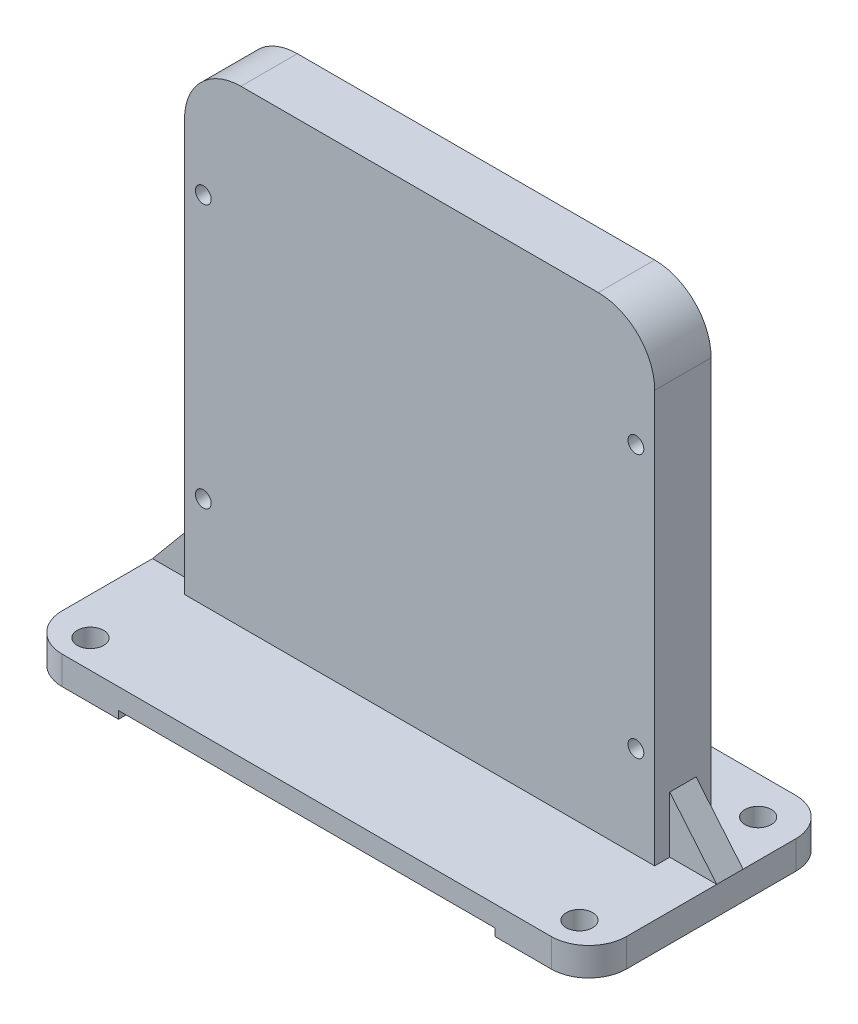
ISO-10303-21;
HEADER;
FILE_DESCRIPTION(('STEP AP214'),'2;1');
FILE_NAME('part.step','',(''),(''),'','','');
FILE_SCHEMA(('AUTOMOTIVE_DESIGN { 1 0 10303 214 1 1 1 1 }'));
ENDSEC;
DATA;
#1=APPLICATION_CONTEXT('core data for automotive mechanical design processes');
#2=APPLICATION_PROTOCOL_DEFINITION('international standard','automotive_design',2000,#1);
#3=PRODUCT_CONTEXT('',#1,'mechanical');
#4=PRODUCT('Part','Part','',(#3));
#5=PRODUCT_RELATED_PRODUCT_CATEGORY('part','',(#4));
#6=PRODUCT_DEFINITION_FORMATION('','',#4);
#7=PRODUCT_DEFINITION_CONTEXT('part definition',#1,'design');
#8=PRODUCT_DEFINITION('design','',#6,#7);
#9=PRODUCT_DEFINITION_SHAPE('','',#8);
#10=(LENGTH_UNIT() NAMED_UNIT(*) SI_UNIT(.MILLI.,.METRE.));
#11=(NAMED_UNIT(*) PLANE_ANGLE_UNIT() SI_UNIT($,.RADIAN.));
#12=(NAMED_UNIT(*) SI_UNIT($,.STERADIAN.) SOLID_ANGLE_UNIT());
#13=UNCERTAINTY_MEASURE_WITH_UNIT(LENGTH_MEASURE(1.E-05),#10,'distance_accuracy_value','');
#14=(GEOMETRIC_REPRESENTATION_CONTEXT(3) GLOBAL_UNCERTAINTY_ASSIGNED_CONTEXT((#13)) GLOBAL_UNIT_ASSIGNED_CONTEXT((#10,
#11,#12)) REPRESENTATION_CONTEXT('',''));
#15=CARTESIAN_POINT('',(0.,0.,0.));
#16=DIRECTION('',(0.,0.,1.));
#17=DIRECTION('',(1.,0.,0.));
#18=AXIS2_PLACEMENT_3D('',#15,#16,#17);
#19=CARTESIAN_POINT('',(62.5,-66.,7.5));
#20=DIRECTION('',(0.,1.,0.));
#21=DIRECTION('',(0.,0.,1.));
#22=AXIS2_PLACEMENT_3D('',#19,#20,#21);
#23=PLANE('',#22);
#24=CARTESIAN_POINT('',(-65.,-66.,30.));
#25=DIRECTION('',(0.,1.,0.));
#26=DIRECTION('',(0.,0.,1.));
#27=AXIS2_PLACEMENT_3D('',#24,#25,#26);
#28=CIRCLE('',#27,3.5);
#29=CARTESIAN_POINT('',(-65.,-66.,33.5));
#30=VERTEX_POINT('',#29);
#31=EDGE_CURVE('E264',#30,#30,#28,.T.);
#32=ORIENTED_EDGE('',*,*,#31,.T.);
#33=EDGE_LOOP('',(#32));
#34=FACE_BOUND('',#33,.T.);
#35=CARTESIAN_POINT('',(-65.,-66.,-17.5));
#36=DIRECTION('',(0.,1.,0.));
#37=DIRECTION('',(0.,0.,1.));
#38=AXIS2_PLACEMENT_3D('',#35,#36,#37);
#39=CIRCLE('',#38,3.5);
#40=CARTESIAN_POINT('',(-65.,-66.,-14.));
#41=VERTEX_POINT('',#40);
#42=EDGE_CURVE('E260',#41,#41,#39,.T.);
#43=ORIENTED_EDGE('',*,*,#42,.T.);
#44=EDGE_LOOP('',(#43));
#45=FACE_BOUND('',#44,.T.);
#46=DIRECTION('',(1.,0.,0.));
#47=VECTOR('',#46,1.);
#48=CARTESIAN_POINT('',(75.,-66.,-27.5));
#49=LINE('',#48,#47);
#50=CARTESIAN_POINT('',(-65.,-66.,-27.5));
#51=VERTEX_POINT('',#50);
#52=CARTESIAN_POINT('',(-50.0000000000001,-66.,-27.5));
#53=VERTEX_POINT('',#52);
#54=EDGE_CURVE('E324',#51,#53,#49,.T.);
#55=ORIENTED_EDGE('',*,*,#54,.T.);
#56=DIRECTION('',(0.,0.,1.));
#57=VECTOR('',#56,1.);
#58=CARTESIAN_POINT('',(-50.0000000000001,-66.,7.5));
#59=LINE('',#58,#57);
#60=CARTESIAN_POINT('',(-50.0000000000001,-66.,37.5));
#61=VERTEX_POINT('',#60);
#62=EDGE_CURVE('E11',#53,#61,#59,.T.);
#63=ORIENTED_EDGE('',*,*,#62,.T.);
#64=DIRECTION('',(-1.,0.,0.));
#65=VECTOR('',#64,1.);
#66=CARTESIAN_POINT('',(75.,-66.,37.5));
#67=LINE('',#66,#65);
#68=CARTESIAN_POINT('',(-65.,-66.,37.5));
#69=VERTEX_POINT('',#68);
#70=EDGE_CURVE('E330',#61,#69,#67,.T.);
#71=ORIENTED_EDGE('',*,*,#70,.T.);
#72=CARTESIAN_POINT('',(-65.,-66.,27.5));
#73=DIRECTION('',(0.,1.,0.));
#74=DIRECTION('',(0.,0.,1.));
#75=AXIS2_PLACEMENT_3D('',#72,#73,#74);
#76=CIRCLE('',#75,10.);
#77=CARTESIAN_POINT('',(-75.,-66.,27.5));
#78=VERTEX_POINT('',#77);
#79=EDGE_CURVE('E386',#69,#78,#76,.F.);
#80=ORIENTED_EDGE('',*,*,#79,.T.);
#81=DIRECTION('',(0.,0.,-1.));
#82=VECTOR('',#81,1.);
#83=CARTESIAN_POINT('',(-75.,-66.,37.5));
#84=LINE('',#83,#82);
#85=CARTESIAN_POINT('',(-75.,-66.,-17.5));
#86=VERTEX_POINT('',#85);
#87=EDGE_CURVE('E306',#78,#86,#84,.T.);
#88=ORIENTED_EDGE('',*,*,#87,.T.);
#89=CARTESIAN_POINT('',(-65.,-66.,-17.5));
#90=DIRECTION('',(0.,1.,0.));
#91=DIRECTION('',(0.,0.,1.));
#92=AXIS2_PLACEMENT_3D('',#89,#90,#91);
#93=CIRCLE('',#92,10.);
#94=EDGE_CURVE('E388',#86,#51,#93,.F.);
#95=ORIENTED_EDGE('',*,*,#94,.T.);
#96=EDGE_LOOP('',(#55,#63,#71,#80,#88,#95));
#97=FACE_BOUND('',#96,.T.);
#98=ADVANCED_FACE('F36',(#34,#45,#97),#23,.F.);
#99=CARTESIAN_POINT('',(0.,-58.5,0.));
#100=DIRECTION('',(0.,1.,0.));
#101=DIRECTION('',(0.,0.,1.));
#102=AXIS2_PLACEMENT_3D('',#99,#100,#101);
#103=PLANE('',#102);
#104=CARTESIAN_POINT('',(65.,-58.5,-17.5));
#105=DIRECTION('',(0.,1.,0.));
#106=DIRECTION('',(0.,0.,1.));
#107=AXIS2_PLACEMENT_3D('',#104,#105,#106);
#108=CIRCLE('',#107,3.5);
#109=CARTESIAN_POINT('',(65.,-58.5,-14.));
#110=VERTEX_POINT('',#109);
#111=EDGE_CURVE('E245',#110,#110,#108,.T.);
#112=ORIENTED_EDGE('',*,*,#111,.F.);
#113=EDGE_LOOP('',(#112));
#114=FACE_BOUND('',#113,.T.);
#115=CARTESIAN_POINT('',(-65.,-58.5,-17.5));
#116=DIRECTION('',(0.,1.,0.));
#117=DIRECTION('',(0.,0.,1.));
#118=AXIS2_PLACEMENT_3D('',#115,#116,#117);
#119=CIRCLE('',#118,3.5);
#120=CARTESIAN_POINT('',(-65.,-58.5,-14.));
#121=VERTEX_POINT('',#120);
#122=EDGE_CURVE('E257',#121,#121,#119,.T.);
#123=ORIENTED_EDGE('',*,*,#122,.F.);
#124=EDGE_LOOP('',(#123));
#125=FACE_BOUND('',#124,.T.);
#126=DIRECTION('',(0.,0.,1.));
#127=VECTOR('',#126,1.);
#128=CARTESIAN_POINT('',(75.,-58.5,37.5));
#129=LINE('',#128,#127);
#130=CARTESIAN_POINT('',(75.,-58.5,-17.5));
#131=VERTEX_POINT('',#130);
#132=CARTESIAN_POINT('',(75.,-58.5,-3.5));
#133=VERTEX_POINT('',#132);
#134=EDGE_CURVE('E315',#131,#133,#129,.T.);
#135=ORIENTED_EDGE('',*,*,#134,.F.);
#136=CARTESIAN_POINT('',(65.,-58.5,-17.5));
#137=DIRECTION('',(0.,1.,0.));
#138=DIRECTION('',(0.,0.,1.));
#139=AXIS2_PLACEMENT_3D('',#136,#137,#138);
#140=CIRCLE('',#139,10.);
#141=CARTESIAN_POINT('',(65.,-58.5,-27.5));
#142=VERTEX_POINT('',#141);
#143=EDGE_CURVE('E401',#131,#142,#140,.T.);
#144=ORIENTED_EDGE('',*,*,#143,.T.);
#145=DIRECTION('',(1.,0.,0.));
#146=VECTOR('',#145,1.);
#147=CARTESIAN_POINT('',(75.,-58.5,-27.5));
#148=LINE('',#147,#146);
#149=CARTESIAN_POINT('',(-65.,-58.5,-27.5));
#150=VERTEX_POINT('',#149);
#151=EDGE_CURVE('E309',#150,#142,#148,.T.);
#152=ORIENTED_EDGE('',*,*,#151,.F.);
#153=CARTESIAN_POINT('',(-65.,-58.5,-17.5));
#154=DIRECTION('',(0.,1.,0.));
#155=DIRECTION('',(0.,0.,1.));
#156=AXIS2_PLACEMENT_3D('',#153,#154,#155);
#157=CIRCLE('',#156,10.);
#158=CARTESIAN_POINT('',(-75.,-58.5,-17.5));
#159=VERTEX_POINT('',#158);
#160=EDGE_CURVE('E399',#150,#159,#157,.T.);
#161=ORIENTED_EDGE('',*,*,#160,.T.);
#162=DIRECTION('',(0.,0.,-1.));
#163=VECTOR('',#162,1.);
#164=CARTESIAN_POINT('',(-75.,-58.5,37.5));
#165=LINE('',#164,#163);
#166=CARTESIAN_POINT('',(-75.,-58.5,-3.5));
#167=VERTEX_POINT('',#166);
#168=EDGE_CURVE('E311',#167,#159,#165,.T.);
#169=ORIENTED_EDGE('',*,*,#168,.F.);
#170=DIRECTION('',(1.,0.,0.));
#171=VECTOR('',#170,1.);
#172=CARTESIAN_POINT('',(0.,-58.5,-3.5));
#173=LINE('',#172,#171);
#174=CARTESIAN_POINT('',(-62.5,-58.5,-3.5));
#175=VERTEX_POINT('',#174);
#176=EDGE_CURVE('E291',#167,#175,#173,.T.);
#177=ORIENTED_EDGE('',*,*,#176,.T.);
#178=DIRECTION('',(0.,0.,1.));
#179=VECTOR('',#178,1.);
#180=CARTESIAN_POINT('',(-62.5,-58.5,7.5));
#181=LINE('',#180,#179);
#182=CARTESIAN_POINT('',(-62.5,-58.5,-7.5));
#183=VERTEX_POINT('',#182);
#184=EDGE_CURVE('E338',#183,#175,#181,.T.);
#185=ORIENTED_EDGE('',*,*,#184,.F.);
#186=DIRECTION('',(1.,0.,0.));
#187=VECTOR('',#186,1.);
#188=CARTESIAN_POINT('',(47.5,-58.5,-7.5));
#189=LINE('',#188,#187);
#190=CARTESIAN_POINT('',(62.5,-58.5,-7.5));
#191=VERTEX_POINT('',#190);
#192=EDGE_CURVE('E377',#183,#191,#189,.T.);
#193=ORIENTED_EDGE('',*,*,#192,.T.);
#194=DIRECTION('',(0.,0.,-1.));
#195=VECTOR('',#194,1.);
#196=CARTESIAN_POINT('',(62.5,-58.5,7.5));
#197=LINE('',#196,#195);
#198=CARTESIAN_POINT('',(62.5,-58.5,-3.5));
#199=VERTEX_POINT('',#198);
#200=EDGE_CURVE('E321',#199,#191,#197,.T.);
#201=ORIENTED_EDGE('',*,*,#200,.F.);
#202=DIRECTION('',(1.,0.,0.));
#203=VECTOR('',#202,1.);
#204=CARTESIAN_POINT('',(0.,-58.5,-3.5));
#205=LINE('',#204,#203);
#206=EDGE_CURVE('E271',#199,#133,#205,.T.);
#207=ORIENTED_EDGE('',*,*,#206,.T.);
#208=EDGE_LOOP('',(#135,#144,#152,#161,#169,#177,#185,#193,#201,#207));
#209=FACE_BOUND('',#208,.T.);
#210=ADVANCED_FACE('F445',(#114,#125,#209),#103,.T.);
#211=CARTESIAN_POINT('',(-62.5,50.9999999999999,7.5));
#212=DIRECTION('',(1.,0.,0.));
#213=DIRECTION('',(0.,1.,0.));
#214=AXIS2_PLACEMENT_3D('',#211,#212,#213);
#215=PLANE('',#214);
#216=DIRECTION('',(0.,0.,-1.));
#217=VECTOR('',#216,1.);
#218=CARTESIAN_POINT('',(-62.5,50.9999999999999,7.5));
#219=LINE('',#218,#217);
#220=CARTESIAN_POINT('',(-62.5,50.9999999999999,7.5));
#221=VERTEX_POINT('',#220);
#222=CARTESIAN_POINT('',(-62.5,50.9999999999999,-7.5));
#223=VERTEX_POINT('',#222);
#224=EDGE_CURVE('E356',#221,#223,#219,.T.);
#225=ORIENTED_EDGE('',*,*,#224,.T.);
#226=DIRECTION('',(0.,-1.,0.));
#227=VECTOR('',#226,1.);
#228=CARTESIAN_POINT('',(-62.5,50.9999999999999,-7.5));
#229=LINE('',#228,#227);
#230=EDGE_CURVE('E343',#223,#183,#229,.T.);
#231=ORIENTED_EDGE('',*,*,#230,.T.);
#232=ORIENTED_EDGE('',*,*,#184,.T.);
#233=DIRECTION('',(0.,-1.,0.));
#234=VECTOR('',#233,1.);
#235=CARTESIAN_POINT('',(-62.5,50.9999999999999,-3.5));
#236=LINE('',#235,#234);
#237=CARTESIAN_POINT('',(-62.5,-43.5,-3.5));
#238=VERTEX_POINT('',#237);
#239=EDGE_CURVE('E296',#238,#175,#236,.T.);
#240=ORIENTED_EDGE('',*,*,#239,.F.);
#241=DIRECTION('',(0.,0.,-1.));
#242=VECTOR('',#241,1.);
#243=CARTESIAN_POINT('',(-62.5,-43.5,7.5));
#244=LINE('',#243,#242);
#245=CARTESIAN_POINT('',(-62.5,-43.5,3.5));
#246=VERTEX_POINT('',#245);
#247=EDGE_CURVE('E303',#238,#246,#244,.F.);
#248=ORIENTED_EDGE('',*,*,#247,.T.);
#249=DIRECTION('',(0.,-1.,0.));
#250=VECTOR('',#249,1.);
#251=CARTESIAN_POINT('',(-62.5,50.9999999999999,3.5));
#252=LINE('',#251,#250);
#253=CARTESIAN_POINT('',(-62.5,-58.5,3.5));
#254=VERTEX_POINT('',#253);
#255=EDGE_CURVE('E300',#246,#254,#252,.T.);
#256=ORIENTED_EDGE('',*,*,#255,.T.);
#257=CARTESIAN_POINT('',(-62.5,-58.5,7.5));
#258=VERTEX_POINT('',#257);
#259=EDGE_CURVE('E337',#254,#258,#181,.T.);
#260=ORIENTED_EDGE('',*,*,#259,.T.);
#261=DIRECTION('',(0.,-1.,0.));
#262=VECTOR('',#261,1.);
#263=CARTESIAN_POINT('',(-62.5,50.9999999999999,7.5));
#264=LINE('',#263,#262);
#265=EDGE_CURVE('E344',#221,#258,#264,.T.);
#266=ORIENTED_EDGE('',*,*,#265,.F.);
#267=EDGE_LOOP('',(#225,#231,#232,#240,#248,#256,#260,#266));
#268=FACE_BOUND('',#267,.T.);
#269=ADVANCED_FACE('F465',(#268),#215,.F.);
#270=CARTESIAN_POINT('',(62.5,50.9999999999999,7.5));
#271=DIRECTION('',(-1.,0.,0.));
#272=DIRECTION('',(0.,-1.,0.));
#273=AXIS2_PLACEMENT_3D('',#270,#271,#272);
#274=PLANE('',#273);
#275=CARTESIAN_POINT('',(62.5,-58.5,7.5));
#276=VERTEX_POINT('',#275);
#277=CARTESIAN_POINT('',(62.5,-58.5,3.5));
#278=VERTEX_POINT('',#277);
#279=EDGE_CURVE('E334',#276,#278,#197,.T.);
#280=ORIENTED_EDGE('',*,*,#279,.T.);
#281=DIRECTION('',(0.,1.,0.));
#282=VECTOR('',#281,1.);
#283=CARTESIAN_POINT('',(62.5,50.9999999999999,3.5));
#284=LINE('',#283,#282);
#285=CARTESIAN_POINT('',(62.5,-43.5,3.5));
#286=VERTEX_POINT('',#285);
#287=EDGE_CURVE('E281',#278,#286,#284,.T.);
#288=ORIENTED_EDGE('',*,*,#287,.T.);
#289=DIRECTION('',(0.,0.,-1.));
#290=VECTOR('',#289,1.);
#291=CARTESIAN_POINT('',(62.5,-43.5,7.5));
#292=LINE('',#291,#290);
#293=CARTESIAN_POINT('',(62.5,-43.5,-3.5));
#294=VERTEX_POINT('',#293);
#295=EDGE_CURVE('E284',#286,#294,#292,.T.);
#296=ORIENTED_EDGE('',*,*,#295,.T.);
#297=DIRECTION('',(0.,1.,0.));
#298=VECTOR('',#297,1.);
#299=CARTESIAN_POINT('',(62.5,50.9999999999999,-3.5));
#300=LINE('',#299,#298);
#301=EDGE_CURVE('E276',#199,#294,#300,.T.);
#302=ORIENTED_EDGE('',*,*,#301,.F.);
#303=ORIENTED_EDGE('',*,*,#200,.T.);
#304=DIRECTION('',(0.,1.,0.));
#305=VECTOR('',#304,1.);
#306=CARTESIAN_POINT('',(62.5,50.9999999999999,-7.5));
#307=LINE('',#306,#305);
#308=CARTESIAN_POINT('',(62.5,50.9999999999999,-7.5));
#309=VERTEX_POINT('',#308);
#310=EDGE_CURVE('E359',#191,#309,#307,.T.);
#311=ORIENTED_EDGE('',*,*,#310,.T.);
#312=DIRECTION('',(0.,0.,-1.));
#313=VECTOR('',#312,1.);
#314=CARTESIAN_POINT('',(62.5,50.9999999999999,7.5));
#315=LINE('',#314,#313);
#316=CARTESIAN_POINT('',(62.5,50.9999999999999,7.5));
#317=VERTEX_POINT('',#316);
#318=EDGE_CURVE('E375',#317,#309,#315,.T.);
#319=ORIENTED_EDGE('',*,*,#318,.F.);
#320=DIRECTION('',(0.,1.,0.));
#321=VECTOR('',#320,1.);
#322=CARTESIAN_POINT('',(62.5,50.9999999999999,7.5));
#323=LINE('',#322,#321);
#324=EDGE_CURVE('E347',#276,#317,#323,.T.);
#325=ORIENTED_EDGE('',*,*,#324,.F.);
#326=EDGE_LOOP('',(#280,#288,#296,#302,#303,#311,#319,#325));
#327=FACE_BOUND('',#326,.T.);
#328=ADVANCED_FACE('F550',(#327),#274,.F.);
#329=CARTESIAN_POINT('',(47.5,51.,7.5));
#330=DIRECTION('',(0.,0.,-1.));
#331=DIRECTION('',(-1.,0.,0.));
#332=AXIS2_PLACEMENT_3D('',#329,#330,#331);
#333=CYLINDRICAL_SURFACE('',#332,15.);
#334=ORIENTED_EDGE('',*,*,#318,.T.);
#335=CARTESIAN_POINT('',(47.5,51.,-7.5));
#336=DIRECTION('',(0.,0.,1.));
#337=DIRECTION('',(-1.,0.,0.));
#338=AXIS2_PLACEMENT_3D('',#335,#336,#337);
#339=CIRCLE('',#338,15.);
#340=CARTESIAN_POINT('',(47.4999999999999,66.,-7.5));
#341=VERTEX_POINT('',#340);
#342=EDGE_CURVE('E362',#309,#341,#339,.T.);
#343=ORIENTED_EDGE('',*,*,#342,.T.);
#344=DIRECTION('',(0.,0.,-1.));
#345=VECTOR('',#344,1.);
#346=CARTESIAN_POINT('',(47.4999999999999,66.,7.5));
#347=LINE('',#346,#345);
#348=CARTESIAN_POINT('',(47.4999999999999,66.,7.5));
#349=VERTEX_POINT('',#348);
#350=EDGE_CURVE('E373',#349,#341,#347,.T.);
#351=ORIENTED_EDGE('',*,*,#350,.F.);
#352=CARTESIAN_POINT('',(47.5,51.,7.5));
#353=DIRECTION('',(0.,0.,1.));
#354=DIRECTION('',(-1.,0.,0.));
#355=AXIS2_PLACEMENT_3D('',#352,#353,#354);
#356=CIRCLE('',#355,15.);
#357=EDGE_CURVE('E350',#317,#349,#356,.T.);
#358=ORIENTED_EDGE('',*,*,#357,.F.);
#359=EDGE_LOOP('',(#334,#343,#351,#358));
#360=FACE_BOUND('',#359,.T.);
#361=ADVANCED_FACE('F587',(#360),#333,.T.);
#362=CARTESIAN_POINT('',(47.4999999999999,66.,7.5));
#363=DIRECTION('',(0.,-1.,0.));
#364=DIRECTION('',(0.,0.,-1.));
#365=AXIS2_PLACEMENT_3D('',#362,#363,#364);
#366=PLANE('',#365);
#367=DIRECTION('',(-1.,0.,0.));
#368=VECTOR('',#367,1.);
#369=CARTESIAN_POINT('',(47.4999999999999,66.,-7.5));
#370=LINE('',#369,#368);
#371=CARTESIAN_POINT('',(-47.4999999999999,66.,-7.5));
#372=VERTEX_POINT('',#371);
#373=EDGE_CURVE('E365',#341,#372,#370,.T.);
#374=ORIENTED_EDGE('',*,*,#373,.T.);
#375=DIRECTION('',(0.,0.,-1.));
#376=VECTOR('',#375,1.);
#377=CARTESIAN_POINT('',(-47.4999999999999,66.,7.5));
#378=LINE('',#377,#376);
#379=CARTESIAN_POINT('',(-47.4999999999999,66.,7.5));
#380=VERTEX_POINT('',#379);
#381=EDGE_CURVE('E371',#380,#372,#378,.T.);
#382=ORIENTED_EDGE('',*,*,#381,.F.);
#383=DIRECTION('',(-1.,0.,0.));
#384=VECTOR('',#383,1.);
#385=CARTESIAN_POINT('',(47.4999999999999,66.,7.5));
#386=LINE('',#385,#384);
#387=EDGE_CURVE('E352',#349,#380,#386,.T.);
#388=ORIENTED_EDGE('',*,*,#387,.F.);
#389=ORIENTED_EDGE('',*,*,#350,.T.);
#390=EDGE_LOOP('',(#374,#382,#388,#389));
#391=FACE_BOUND('',#390,.T.);
#392=ADVANCED_FACE('F591',(#391),#366,.F.);
#393=CARTESIAN_POINT('',(-47.5,51.,7.5));
#394=DIRECTION('',(0.,0.,-1.));
#395=DIRECTION('',(-1.,0.,0.));
#396=AXIS2_PLACEMENT_3D('',#393,#394,#395);
#397=CYLINDRICAL_SURFACE('',#396,15.);
#398=ORIENTED_EDGE('',*,*,#381,.T.);
#399=CARTESIAN_POINT('',(-47.5,51.,-7.5));
#400=DIRECTION('',(0.,0.,1.));
#401=DIRECTION('',(1.,0.,0.));
#402=AXIS2_PLACEMENT_3D('',#399,#400,#401);
#403=CIRCLE('',#402,15.);
#404=EDGE_CURVE('E348',#372,#223,#403,.T.);
#405=ORIENTED_EDGE('',*,*,#404,.T.);
#406=ORIENTED_EDGE('',*,*,#224,.F.);
#407=CARTESIAN_POINT('',(-47.5,51.,7.5));
#408=DIRECTION('',(0.,0.,1.));
#409=DIRECTION('',(1.,0.,0.));
#410=AXIS2_PLACEMENT_3D('',#407,#408,#409);
#411=CIRCLE('',#410,15.);
#412=EDGE_CURVE('E354',#380,#221,#411,.T.);
#413=ORIENTED_EDGE('',*,*,#412,.F.);
#414=EDGE_LOOP('',(#398,#405,#406,#413));
#415=FACE_BOUND('',#414,.T.);
#416=ADVANCED_FACE('F474',(#415),#397,.T.);
#417=CARTESIAN_POINT('',(47.5,51.,7.5));
#418=DIRECTION('',(0.,0.,-1.));
#419=DIRECTION('',(-1.,0.,0.));
#420=AXIS2_PLACEMENT_3D('',#417,#418,#419);
#421=PLANE('',#420);
#422=CARTESIAN_POINT('',(-57.5,36.,7.5));
#423=DIRECTION('',(0.,0.,1.));
#424=DIRECTION('',(1.,0.,0.));
#425=AXIS2_PLACEMENT_3D('',#422,#423,#424);
#426=CIRCLE('',#425,2.09999999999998);
#427=CARTESIAN_POINT('',(-55.4,36.,7.5));
#428=VERTEX_POINT('',#427);
#429=EDGE_CURVE('E226',#428,#428,#426,.T.);
#430=ORIENTED_EDGE('',*,*,#429,.F.);
#431=EDGE_LOOP('',(#430));
#432=FACE_BOUND('',#431,.T.);
#433=CARTESIAN_POINT('',(57.5,36.,7.5));
#434=DIRECTION('',(0.,0.,1.));
#435=DIRECTION('',(1.,0.,0.));
#436=AXIS2_PLACEMENT_3D('',#433,#434,#435);
#437=CIRCLE('',#436,2.09999999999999);
#438=CARTESIAN_POINT('',(59.6,36.,7.5));
#439=VERTEX_POINT('',#438);
#440=EDGE_CURVE('E233',#439,#439,#437,.T.);
#441=ORIENTED_EDGE('',*,*,#440,.F.);
#442=EDGE_LOOP('',(#441));
#443=FACE_BOUND('',#442,.T.);
#444=CARTESIAN_POINT('',(57.5,-34.,7.5));
#445=DIRECTION('',(0.,0.,1.));
#446=DIRECTION('',(1.,0.,0.));
#447=AXIS2_PLACEMENT_3D('',#444,#445,#446);
#448=CIRCLE('',#447,2.09999999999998);
#449=CARTESIAN_POINT('',(59.6,-34.,7.5));
#450=VERTEX_POINT('',#449);
#451=EDGE_CURVE('E237',#450,#450,#448,.T.);
#452=ORIENTED_EDGE('',*,*,#451,.F.);
#453=EDGE_LOOP('',(#452));
#454=FACE_BOUND('',#453,.T.);
#455=CARTESIAN_POINT('',(-57.5,-34.,7.5));
#456=DIRECTION('',(0.,0.,1.));
#457=DIRECTION('',(1.,0.,0.));
#458=AXIS2_PLACEMENT_3D('',#455,#456,#457);
#459=CIRCLE('',#458,2.09999999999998);
#460=CARTESIAN_POINT('',(-55.4,-34.,7.5));
#461=VERTEX_POINT('',#460);
#462=EDGE_CURVE('E241',#461,#461,#459,.T.);
#463=ORIENTED_EDGE('',*,*,#462,.F.);
#464=EDGE_LOOP('',(#463));
#465=FACE_BOUND('',#464,.T.);
#466=ORIENTED_EDGE('',*,*,#265,.T.);
#467=DIRECTION('',(1.,0.,0.));
#468=VECTOR('',#467,1.);
#469=CARTESIAN_POINT('',(47.5,-58.5,7.5));
#470=LINE('',#469,#468);
#471=EDGE_CURVE('E341',#258,#276,#470,.T.);
#472=ORIENTED_EDGE('',*,*,#471,.T.);
#473=ORIENTED_EDGE('',*,*,#324,.T.);
#474=ORIENTED_EDGE('',*,*,#357,.T.);
#475=ORIENTED_EDGE('',*,*,#387,.T.);
#476=ORIENTED_EDGE('',*,*,#412,.T.);
#477=EDGE_LOOP('',(#466,#472,#473,#474,#475,#476));
#478=FACE_BOUND('',#477,.T.);
#479=ADVANCED_FACE('F467',(#432,#443,#454,#465,#478),#421,.F.);
#480=CARTESIAN_POINT('',(47.5,51.,-7.5));
#481=DIRECTION('',(0.,0.,-1.));
#482=DIRECTION('',(-1.,0.,0.));
#483=AXIS2_PLACEMENT_3D('',#480,#481,#482);
#484=PLANE('',#483);
#485=CARTESIAN_POINT('',(-57.5,36.,-7.5));
#486=DIRECTION('',(0.,0.,-1.));
#487=DIRECTION('',(-1.,0.,0.));
#488=AXIS2_PLACEMENT_3D('',#485,#486,#487);
#489=CIRCLE('',#488,2.09999999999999);
#490=CARTESIAN_POINT('',(-59.6,36.,-7.5));
#491=VERTEX_POINT('',#490);
#492=EDGE_CURVE('E230',#491,#491,#489,.T.);
#493=ORIENTED_EDGE('',*,*,#492,.F.);
#494=EDGE_LOOP('',(#493));
#495=FACE_BOUND('',#494,.T.);
#496=CARTESIAN_POINT('',(57.5,36.,-7.5));
#497=DIRECTION('',(0.,0.,-1.));
#498=DIRECTION('',(-1.,0.,0.));
#499=AXIS2_PLACEMENT_3D('',#496,#497,#498);
#500=CIRCLE('',#499,2.09999999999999);
#501=CARTESIAN_POINT('',(55.4,36.,-7.5));
#502=VERTEX_POINT('',#501);
#503=EDGE_CURVE('E236',#502,#502,#500,.T.);
#504=ORIENTED_EDGE('',*,*,#503,.F.);
#505=EDGE_LOOP('',(#504));
#506=FACE_BOUND('',#505,.T.);
#507=CARTESIAN_POINT('',(57.5,-34.,-7.5));
#508=DIRECTION('',(0.,0.,-1.));
#509=DIRECTION('',(-1.,0.,0.));
#510=AXIS2_PLACEMENT_3D('',#507,#508,#509);
#511=CIRCLE('',#510,2.09999999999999);
#512=CARTESIAN_POINT('',(55.4,-34.,-7.5));
#513=VERTEX_POINT('',#512);
#514=EDGE_CURVE('E240',#513,#513,#511,.T.);
#515=ORIENTED_EDGE('',*,*,#514,.F.);
#516=EDGE_LOOP('',(#515));
#517=FACE_BOUND('',#516,.T.);
#518=CARTESIAN_POINT('',(-57.5,-34.,-7.5));
#519=DIRECTION('',(0.,0.,-1.));
#520=DIRECTION('',(-1.,0.,0.));
#521=AXIS2_PLACEMENT_3D('',#518,#519,#520);
#522=CIRCLE('',#521,2.09999999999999);
#523=CARTESIAN_POINT('',(-59.6,-34.,-7.5));
#524=VERTEX_POINT('',#523);
#525=EDGE_CURVE('E244',#524,#524,#522,.T.);
#526=ORIENTED_EDGE('',*,*,#525,.F.);
#527=EDGE_LOOP('',(#526));
#528=FACE_BOUND('',#527,.T.);
#529=ORIENTED_EDGE('',*,*,#192,.F.);
#530=ORIENTED_EDGE('',*,*,#230,.F.);
#531=ORIENTED_EDGE('',*,*,#404,.F.);
#532=ORIENTED_EDGE('',*,*,#373,.F.);
#533=ORIENTED_EDGE('',*,*,#342,.F.);
#534=ORIENTED_EDGE('',*,*,#310,.F.);
#535=EDGE_LOOP('',(#529,#530,#531,#532,#533,#534));
#536=FACE_BOUND('',#535,.T.);
#537=ADVANCED_FACE('F600',(#495,#506,#517,#528,#536),#484,.T.);
#538=CARTESIAN_POINT('',(65.,-58.5,30.));
#539=DIRECTION('',(0.,1.,0.));
#540=DIRECTION('',(0.,0.,1.));
#541=AXIS2_PLACEMENT_3D('',#538,#539,#540);
#542=CIRCLE('',#541,3.5);
#543=CARTESIAN_POINT('',(65.,-58.5,33.5));
#544=VERTEX_POINT('',#543);
#545=EDGE_CURVE('E251',#544,#544,#542,.T.);
#546=ORIENTED_EDGE('',*,*,#545,.F.);
#547=EDGE_LOOP('',(#546));
#548=FACE_BOUND('',#547,.T.);
#549=CARTESIAN_POINT('',(-65.,-58.5,30.));
#550=DIRECTION('',(0.,1.,0.));
#551=DIRECTION('',(0.,0.,1.));
#552=AXIS2_PLACEMENT_3D('',#549,#550,#551);
#553=CIRCLE('',#552,3.5);
#554=CARTESIAN_POINT('',(-65.,-58.5,33.5));
#555=VERTEX_POINT('',#554);
#556=EDGE_CURVE('E261',#555,#555,#553,.T.);
#557=ORIENTED_EDGE('',*,*,#556,.F.);
#558=EDGE_LOOP('',(#557));
#559=FACE_BOUND('',#558,.T.);
#560=DIRECTION('',(-1.,0.,0.));
#561=VECTOR('',#560,1.);
#562=CARTESIAN_POINT('',(75.,-58.5,37.5));
#563=LINE('',#562,#561);
#564=CARTESIAN_POINT('',(65.,-58.5,37.5));
#565=VERTEX_POINT('',#564);
#566=CARTESIAN_POINT('',(-65.,-58.5,37.5));
#567=VERTEX_POINT('',#566);
#568=EDGE_CURVE('E317',#565,#567,#563,.T.);
#569=ORIENTED_EDGE('',*,*,#568,.F.);
#570=CARTESIAN_POINT('',(65.,-58.5,27.5));
#571=DIRECTION('',(0.,1.,0.));
#572=DIRECTION('',(0.,0.,1.));
#573=AXIS2_PLACEMENT_3D('',#570,#571,#572);
#574=CIRCLE('',#573,10.);
#575=CARTESIAN_POINT('',(75.,-58.5,27.5));
#576=VERTEX_POINT('',#575);
#577=EDGE_CURVE('E410',#565,#576,#574,.T.);
#578=ORIENTED_EDGE('',*,*,#577,.T.);
#579=CARTESIAN_POINT('',(75.,-58.5,3.5));
#580=VERTEX_POINT('',#579);
#581=EDGE_CURVE('E314',#580,#576,#129,.T.);
#582=ORIENTED_EDGE('',*,*,#581,.F.);
#583=DIRECTION('',(1.,0.,0.));
#584=VECTOR('',#583,1.);
#585=CARTESIAN_POINT('',(0.,-58.5,3.5));
#586=LINE('',#585,#584);
#587=EDGE_CURVE('E278',#278,#580,#586,.T.);
#588=ORIENTED_EDGE('',*,*,#587,.F.);
#589=ORIENTED_EDGE('',*,*,#279,.F.);
#590=ORIENTED_EDGE('',*,*,#471,.F.);
#591=ORIENTED_EDGE('',*,*,#259,.F.);
#592=DIRECTION('',(1.,0.,0.));
#593=VECTOR('',#592,1.);
#594=CARTESIAN_POINT('',(0.,-58.5,3.5));
#595=LINE('',#594,#593);
#596=CARTESIAN_POINT('',(-75.,-58.5,3.5));
#597=VERTEX_POINT('',#596);
#598=EDGE_CURVE('E298',#597,#254,#595,.T.);
#599=ORIENTED_EDGE('',*,*,#598,.F.);
#600=CARTESIAN_POINT('',(-75.,-58.5,27.5));
#601=VERTEX_POINT('',#600);
#602=EDGE_CURVE('E307',#601,#597,#165,.T.);
#603=ORIENTED_EDGE('',*,*,#602,.F.);
#604=CARTESIAN_POINT('',(-65.,-58.5,27.5));
#605=DIRECTION('',(0.,1.,0.));
#606=DIRECTION('',(0.,0.,1.));
#607=AXIS2_PLACEMENT_3D('',#604,#605,#606);
#608=CIRCLE('',#607,10.);
#609=EDGE_CURVE('E408',#601,#567,#608,.T.);
#610=ORIENTED_EDGE('',*,*,#609,.T.);
#611=EDGE_LOOP('',(#569,#578,#582,#588,#589,#590,#591,#599,#603,#610));
#612=FACE_BOUND('',#611,.T.);
#613=ADVANCED_FACE('F459',(#548,#559,#612),#103,.T.);
#614=CARTESIAN_POINT('',(-75.,-58.5,37.5));
#615=DIRECTION('',(-1.,0.,0.));
#616=DIRECTION('',(0.,0.,1.));
#617=AXIS2_PLACEMENT_3D('',#614,#615,#616);
#618=PLANE('',#617);
#619=ORIENTED_EDGE('',*,*,#168,.T.);
#620=DIRECTION('',(0.,-1.,0.));
#621=VECTOR('',#620,1.);
#622=CARTESIAN_POINT('',(-75.,-58.5,-17.5));
#623=LINE('',#622,#621);
#624=EDGE_CURVE('E413',#159,#86,#623,.T.);
#625=ORIENTED_EDGE('',*,*,#624,.T.);
#626=ORIENTED_EDGE('',*,*,#87,.F.);
#627=DIRECTION('',(0.,-1.,0.));
#628=VECTOR('',#627,1.);
#629=CARTESIAN_POINT('',(-75.,-58.5,27.5));
#630=LINE('',#629,#628);
#631=EDGE_CURVE('E59',#78,#601,#630,.F.);
#632=ORIENTED_EDGE('',*,*,#631,.T.);
#633=ORIENTED_EDGE('',*,*,#602,.T.);
#634=EDGE_CURVE('E310',#597,#167,#165,.T.);
#635=ORIENTED_EDGE('',*,*,#634,.T.);
#636=EDGE_LOOP('',(#619,#625,#626,#632,#633,#635));
#637=FACE_BOUND('',#636,.T.);
#638=ADVANCED_FACE('F447',(#637),#618,.T.);
#639=CARTESIAN_POINT('',(75.,-58.5,37.5));
#640=DIRECTION('',(0.,0.,1.));
#641=DIRECTION('',(1.,0.,0.));
#642=AXIS2_PLACEMENT_3D('',#639,#640,#641);
#643=PLANE('',#642);
#644=DIRECTION('',(0.,-1.,0.));
#645=VECTOR('',#644,1.);
#646=CARTESIAN_POINT('',(-50.0000000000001,-64.,37.5));
#647=LINE('',#646,#645);
#648=CARTESIAN_POINT('',(-50.0000000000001,-64.,37.5));
#649=VERTEX_POINT('',#648);
#650=EDGE_CURVE('E222',#649,#61,#647,.T.);
#651=ORIENTED_EDGE('',*,*,#650,.F.);
#652=DIRECTION('',(-1.,0.,0.));
#653=VECTOR('',#652,1.);
#654=CARTESIAN_POINT('',(49.9999999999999,-64.,37.5));
#655=LINE('',#654,#653);
#656=CARTESIAN_POINT('',(49.9999999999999,-64.,37.5));
#657=VERTEX_POINT('',#656);
#658=EDGE_CURVE('E219',#657,#649,#655,.T.);
#659=ORIENTED_EDGE('',*,*,#658,.F.);
#660=DIRECTION('',(0.,1.,0.));
#661=VECTOR('',#660,1.);
#662=CARTESIAN_POINT('',(49.9999999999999,-64.,37.5));
#663=LINE('',#662,#661);
#664=CARTESIAN_POINT('',(49.9999999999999,-66.,37.5));
#665=VERTEX_POINT('',#664);
#666=EDGE_CURVE('E200',#665,#657,#663,.T.);
#667=ORIENTED_EDGE('',*,*,#666,.F.);
#668=CARTESIAN_POINT('',(65.,-66.,37.5));
#669=VERTEX_POINT('',#668);
#670=EDGE_CURVE('E331',#669,#665,#67,.T.);
#671=ORIENTED_EDGE('',*,*,#670,.F.);
#672=DIRECTION('',(0.,-1.,0.));
#673=VECTOR('',#672,1.);
#674=CARTESIAN_POINT('',(65.,-58.5,37.5));
#675=LINE('',#674,#673);
#676=EDGE_CURVE('E406',#669,#565,#675,.F.);
#677=ORIENTED_EDGE('',*,*,#676,.T.);
#678=ORIENTED_EDGE('',*,*,#568,.T.);
#679=DIRECTION('',(0.,-1.,0.));
#680=VECTOR('',#679,1.);
#681=CARTESIAN_POINT('',(-65.,-58.5,37.5));
#682=LINE('',#681,#680);
#683=EDGE_CURVE('E403',#567,#69,#682,.T.);
#684=ORIENTED_EDGE('',*,*,#683,.T.);
#685=ORIENTED_EDGE('',*,*,#70,.F.);
#686=EDGE_LOOP('',(#651,#659,#667,#671,#677,#678,#684,#685));
#687=FACE_BOUND('',#686,.T.);
#688=ADVANCED_FACE('F427',(#687),#643,.T.);
#689=CARTESIAN_POINT('',(75.,-58.5,37.5));
#690=DIRECTION('',(1.,0.,0.));
#691=DIRECTION('',(0.,0.,-1.));
#692=AXIS2_PLACEMENT_3D('',#689,#690,#691);
#693=PLANE('',#692);
#694=DIRECTION('',(0.,0.,1.));
#695=VECTOR('',#694,1.);
#696=CARTESIAN_POINT('',(75.,-66.,37.5));
#697=LINE('',#696,#695);
#698=CARTESIAN_POINT('',(75.,-66.,-17.5));
#699=VERTEX_POINT('',#698);
#700=CARTESIAN_POINT('',(75.,-66.,27.5));
#701=VERTEX_POINT('',#700);
#702=EDGE_CURVE('E327',#699,#701,#697,.T.);
#703=ORIENTED_EDGE('',*,*,#702,.F.);
#704=DIRECTION('',(0.,-1.,0.));
#705=VECTOR('',#704,1.);
#706=CARTESIAN_POINT('',(75.,-58.5,-17.5));
#707=LINE('',#706,#705);
#708=EDGE_CURVE('E397',#699,#131,#707,.F.);
#709=ORIENTED_EDGE('',*,*,#708,.T.);
#710=ORIENTED_EDGE('',*,*,#134,.T.);
#711=EDGE_CURVE('E318',#133,#580,#129,.T.);
#712=ORIENTED_EDGE('',*,*,#711,.T.);
#713=ORIENTED_EDGE('',*,*,#581,.T.);
#714=DIRECTION('',(0.,-1.,0.));
#715=VECTOR('',#714,1.);
#716=CARTESIAN_POINT('',(75.,-58.5,27.5));
#717=LINE('',#716,#715);
#718=EDGE_CURVE('E394',#576,#701,#717,.T.);
#719=ORIENTED_EDGE('',*,*,#718,.T.);
#720=EDGE_LOOP('',(#703,#709,#710,#712,#713,#719));
#721=FACE_BOUND('',#720,.T.);
#722=ADVANCED_FACE('F512',(#721),#693,.T.);
#723=CARTESIAN_POINT('',(75.,-58.5,-27.5));
#724=DIRECTION('',(0.,0.,-1.));
#725=DIRECTION('',(-1.,0.,0.));
#726=AXIS2_PLACEMENT_3D('',#723,#724,#725);
#727=PLANE('',#726);
#728=DIRECTION('',(0.,-1.,0.));
#729=VECTOR('',#728,1.);
#730=CARTESIAN_POINT('',(-50.0000000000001,-64.,-27.5));
#731=LINE('',#730,#729);
#732=CARTESIAN_POINT('',(-50.0000000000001,-64.,-27.5));
#733=VERTEX_POINT('',#732);
#734=EDGE_CURVE('E217',#733,#53,#731,.T.);
#735=ORIENTED_EDGE('',*,*,#734,.T.);
#736=ORIENTED_EDGE('',*,*,#54,.F.);
#737=DIRECTION('',(0.,-1.,0.));
#738=VECTOR('',#737,1.);
#739=CARTESIAN_POINT('',(-65.,-58.5,-27.5));
#740=LINE('',#739,#738);
#741=EDGE_CURVE('E380',#51,#150,#740,.F.);
#742=ORIENTED_EDGE('',*,*,#741,.T.);
#743=ORIENTED_EDGE('',*,*,#151,.T.);
#744=DIRECTION('',(0.,-1.,0.));
#745=VECTOR('',#744,1.);
#746=CARTESIAN_POINT('',(65.,-58.5,-27.5));
#747=LINE('',#746,#745);
#748=CARTESIAN_POINT('',(65.,-66.,-27.5));
#749=VERTEX_POINT('',#748);
#750=EDGE_CURVE('E384',#142,#749,#747,.T.);
#751=ORIENTED_EDGE('',*,*,#750,.T.);
#752=CARTESIAN_POINT('',(49.9999999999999,-66.,-27.5));
#753=VERTEX_POINT('',#752);
#754=EDGE_CURVE('E216',#753,#749,#49,.T.);
#755=ORIENTED_EDGE('',*,*,#754,.F.);
#756=DIRECTION('',(0.,1.,0.));
#757=VECTOR('',#756,1.);
#758=CARTESIAN_POINT('',(49.9999999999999,-64.,-27.5));
#759=LINE('',#758,#757);
#760=CARTESIAN_POINT('',(49.9999999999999,-64.,-27.5));
#761=VERTEX_POINT('',#760);
#762=EDGE_CURVE('E51',#753,#761,#759,.T.);
#763=ORIENTED_EDGE('',*,*,#762,.T.);
#764=DIRECTION('',(-1.,0.,0.));
#765=VECTOR('',#764,1.);
#766=CARTESIAN_POINT('',(49.9999999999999,-64.,-27.5));
#767=LINE('',#766,#765);
#768=EDGE_CURVE('E205',#761,#733,#767,.T.);
#769=ORIENTED_EDGE('',*,*,#768,.T.);
#770=EDGE_LOOP('',(#735,#736,#742,#743,#751,#755,#763,#769));
#771=FACE_BOUND('',#770,.T.);
#772=ADVANCED_FACE('F214',(#771),#727,.T.);
#773=CARTESIAN_POINT('',(65.,-66.,-17.5));
#774=DIRECTION('',(0.,1.,0.));
#775=DIRECTION('',(0.,0.,1.));
#776=AXIS2_PLACEMENT_3D('',#773,#774,#775);
#777=CIRCLE('',#776,3.5);
#778=CARTESIAN_POINT('',(65.,-66.,-14.));
#779=VERTEX_POINT('',#778);
#780=EDGE_CURVE('E248',#779,#779,#777,.T.);
#781=ORIENTED_EDGE('',*,*,#780,.T.);
#782=EDGE_LOOP('',(#781));
#783=FACE_BOUND('',#782,.T.);
#784=CARTESIAN_POINT('',(65.,-66.,30.));
#785=DIRECTION('',(0.,1.,0.));
#786=DIRECTION('',(0.,0.,1.));
#787=AXIS2_PLACEMENT_3D('',#784,#785,#786);
#788=CIRCLE('',#787,3.5);
#789=CARTESIAN_POINT('',(65.,-66.,33.5));
#790=VERTEX_POINT('',#789);
#791=EDGE_CURVE('E254',#790,#790,#788,.T.);
#792=ORIENTED_EDGE('',*,*,#791,.T.);
#793=EDGE_LOOP('',(#792));
#794=FACE_BOUND('',#793,.T.);
#795=ORIENTED_EDGE('',*,*,#670,.T.);
#796=DIRECTION('',(0.,0.,-1.));
#797=VECTOR('',#796,1.);
#798=CARTESIAN_POINT('',(49.9999999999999,-66.,7.5));
#799=LINE('',#798,#797);
#800=EDGE_CURVE('E44',#665,#753,#799,.T.);
#801=ORIENTED_EDGE('',*,*,#800,.T.);
#802=ORIENTED_EDGE('',*,*,#754,.T.);
#803=CARTESIAN_POINT('',(65.,-66.,-17.5));
#804=DIRECTION('',(0.,1.,0.));
#805=DIRECTION('',(0.,0.,1.));
#806=AXIS2_PLACEMENT_3D('',#803,#804,#805);
#807=CIRCLE('',#806,10.);
#808=EDGE_CURVE('E392',#749,#699,#807,.F.);
#809=ORIENTED_EDGE('',*,*,#808,.T.);
#810=ORIENTED_EDGE('',*,*,#702,.T.);
#811=CARTESIAN_POINT('',(65.,-66.,27.5));
#812=DIRECTION('',(0.,1.,0.));
#813=DIRECTION('',(0.,0.,1.));
#814=AXIS2_PLACEMENT_3D('',#811,#812,#813);
#815=CIRCLE('',#814,10.);
#816=EDGE_CURVE('E390',#701,#669,#815,.F.);
#817=ORIENTED_EDGE('',*,*,#816,.T.);
#818=EDGE_LOOP('',(#795,#801,#802,#809,#810,#817));
#819=FACE_BOUND('',#818,.T.);
#820=ADVANCED_FACE('F422',(#783,#794,#819),#23,.F.);
#821=CARTESIAN_POINT('',(-75.,-58.5,0.));
#822=DIRECTION('',(0.768221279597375,-0.640184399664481,0.));
#823=DIRECTION('',(0.640184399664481,0.768221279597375,0.));
#824=AXIS2_PLACEMENT_3D('',#821,#822,#823);
#825=PLANE('',#824);
#826=ORIENTED_EDGE('',*,*,#247,.F.);
#827=DIRECTION('',(0.640184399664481,0.768221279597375,0.));
#828=VECTOR('',#827,1.);
#829=CARTESIAN_POINT('',(-75.,-58.5,-3.5));
#830=LINE('',#829,#828);
#831=EDGE_CURVE('E287',#167,#238,#830,.T.);
#832=ORIENTED_EDGE('',*,*,#831,.F.);
#833=ORIENTED_EDGE('',*,*,#634,.F.);
#834=DIRECTION('',(0.640184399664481,0.768221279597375,0.));
#835=VECTOR('',#834,1.);
#836=CARTESIAN_POINT('',(-75.,-58.5,3.5));
#837=LINE('',#836,#835);
#838=EDGE_CURVE('E288',#597,#246,#837,.T.);
#839=ORIENTED_EDGE('',*,*,#838,.T.);
#840=EDGE_LOOP('',(#826,#832,#833,#839));
#841=FACE_BOUND('',#840,.T.);
#842=ADVANCED_FACE('F451',(#841),#825,.F.);
#843=CARTESIAN_POINT('',(0.,0.,3.5));
#844=DIRECTION('',(0.,0.,1.));
#845=DIRECTION('',(1.,0.,0.));
#846=AXIS2_PLACEMENT_3D('',#843,#844,#845);
#847=PLANE('',#846);
#848=ORIENTED_EDGE('',*,*,#255,.F.);
#849=ORIENTED_EDGE('',*,*,#838,.F.);
#850=ORIENTED_EDGE('',*,*,#598,.T.);
#851=EDGE_LOOP('',(#848,#849,#850));
#852=FACE_BOUND('',#851,.T.);
#853=ADVANCED_FACE('F455',(#852),#847,.T.);
#854=CARTESIAN_POINT('',(0.,0.,-3.5));
#855=DIRECTION('',(0.,0.,1.));
#856=DIRECTION('',(1.,0.,0.));
#857=AXIS2_PLACEMENT_3D('',#854,#855,#856);
#858=PLANE('',#857);
#859=ORIENTED_EDGE('',*,*,#831,.T.);
#860=ORIENTED_EDGE('',*,*,#239,.T.);
#861=ORIENTED_EDGE('',*,*,#176,.F.);
#862=EDGE_LOOP('',(#859,#860,#861));
#863=FACE_BOUND('',#862,.T.);
#864=ADVANCED_FACE('F482',(#863),#858,.F.);
#865=CARTESIAN_POINT('',(75.,-58.5,0.));
#866=DIRECTION('',(0.768221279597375,0.640184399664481,0.));
#867=DIRECTION('',(-0.640184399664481,0.768221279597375,0.));
#868=AXIS2_PLACEMENT_3D('',#865,#866,#867);
#869=PLANE('',#868);
#870=ORIENTED_EDGE('',*,*,#295,.F.);
#871=DIRECTION('',(-0.640184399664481,0.768221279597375,0.));
#872=VECTOR('',#871,1.);
#873=CARTESIAN_POINT('',(75.,-58.5,3.5));
#874=LINE('',#873,#872);
#875=EDGE_CURVE('E268',#580,#286,#874,.T.);
#876=ORIENTED_EDGE('',*,*,#875,.F.);
#877=ORIENTED_EDGE('',*,*,#711,.F.);
#878=DIRECTION('',(-0.640184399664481,0.768221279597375,0.));
#879=VECTOR('',#878,1.);
#880=CARTESIAN_POINT('',(75.,-58.5,-3.5));
#881=LINE('',#880,#879);
#882=EDGE_CURVE('E267',#133,#294,#881,.T.);
#883=ORIENTED_EDGE('',*,*,#882,.T.);
#884=EDGE_LOOP('',(#870,#876,#877,#883));
#885=FACE_BOUND('',#884,.T.);
#886=ADVANCED_FACE('F484',(#885),#869,.T.);
#887=CARTESIAN_POINT('',(0.,0.,3.5));
#888=DIRECTION('',(0.,0.,1.));
#889=DIRECTION('',(1.,0.,0.));
#890=AXIS2_PLACEMENT_3D('',#887,#888,#889);
#891=PLANE('',#890);
#892=ORIENTED_EDGE('',*,*,#287,.F.);
#893=ORIENTED_EDGE('',*,*,#587,.T.);
#894=ORIENTED_EDGE('',*,*,#875,.T.);
#895=EDGE_LOOP('',(#892,#893,#894));
#896=FACE_BOUND('',#895,.T.);
#897=ADVANCED_FACE('F490',(#896),#891,.T.);
#898=CARTESIAN_POINT('',(0.,0.,-3.5));
#899=DIRECTION('',(0.,0.,1.));
#900=DIRECTION('',(1.,0.,0.));
#901=AXIS2_PLACEMENT_3D('',#898,#899,#900);
#902=PLANE('',#901);
#903=ORIENTED_EDGE('',*,*,#206,.F.);
#904=ORIENTED_EDGE('',*,*,#301,.T.);
#905=ORIENTED_EDGE('',*,*,#882,.F.);
#906=EDGE_LOOP('',(#903,#904,#905));
#907=FACE_BOUND('',#906,.T.);
#908=ADVANCED_FACE('F538',(#907),#902,.F.);
#909=CARTESIAN_POINT('',(-65.,-58.5,30.));
#910=DIRECTION('',(0.,1.,0.));
#911=DIRECTION('',(0.,0.,1.));
#912=AXIS2_PLACEMENT_3D('',#909,#910,#911);
#913=CYLINDRICAL_SURFACE('',#912,3.5);
#914=ORIENTED_EDGE('',*,*,#556,.T.);
#915=EDGE_LOOP('',(#914));
#916=FACE_BOUND('',#915,.T.);
#917=ORIENTED_EDGE('',*,*,#31,.F.);
#918=EDGE_LOOP('',(#917));
#919=FACE_BOUND('',#918,.T.);
#920=ADVANCED_FACE('F531',(#916,#919),#913,.F.);
#921=CARTESIAN_POINT('',(-65.,-58.5,-17.5));
#922=DIRECTION('',(0.,1.,0.));
#923=DIRECTION('',(0.,0.,1.));
#924=AXIS2_PLACEMENT_3D('',#921,#922,#923);
#925=CYLINDRICAL_SURFACE('',#924,3.5);
#926=ORIENTED_EDGE('',*,*,#122,.T.);
#927=EDGE_LOOP('',(#926));
#928=FACE_BOUND('',#927,.T.);
#929=ORIENTED_EDGE('',*,*,#42,.F.);
#930=EDGE_LOOP('',(#929));
#931=FACE_BOUND('',#930,.T.);
#932=ADVANCED_FACE('F521',(#928,#931),#925,.F.);
#933=CARTESIAN_POINT('',(65.,-58.5,30.));
#934=DIRECTION('',(0.,1.,0.));
#935=DIRECTION('',(0.,0.,1.));
#936=AXIS2_PLACEMENT_3D('',#933,#934,#935);
#937=CYLINDRICAL_SURFACE('',#936,3.5);
#938=ORIENTED_EDGE('',*,*,#545,.T.);
#939=EDGE_LOOP('',(#938));
#940=FACE_BOUND('',#939,.T.);
#941=ORIENTED_EDGE('',*,*,#791,.F.);
#942=EDGE_LOOP('',(#941));
#943=FACE_BOUND('',#942,.T.);
#944=ADVANCED_FACE('F518',(#940,#943),#937,.F.);
#945=CARTESIAN_POINT('',(65.,-58.5,-17.5));
#946=DIRECTION('',(0.,1.,0.));
#947=DIRECTION('',(0.,0.,1.));
#948=AXIS2_PLACEMENT_3D('',#945,#946,#947);
#949=CYLINDRICAL_SURFACE('',#948,3.5);
#950=ORIENTED_EDGE('',*,*,#111,.T.);
#951=EDGE_LOOP('',(#950));
#952=FACE_BOUND('',#951,.T.);
#953=ORIENTED_EDGE('',*,*,#780,.F.);
#954=EDGE_LOOP('',(#953));
#955=FACE_BOUND('',#954,.T.);
#956=ADVANCED_FACE('F520',(#952,#955),#949,.F.);
#957=CARTESIAN_POINT('',(65.,-58.5,-17.5));
#958=DIRECTION('',(0.,-1.,0.));
#959=DIRECTION('',(0.,0.,-1.));
#960=AXIS2_PLACEMENT_3D('',#957,#958,#959);
#961=CYLINDRICAL_SURFACE('',#960,10.);
#962=ORIENTED_EDGE('',*,*,#143,.F.);
#963=ORIENTED_EDGE('',*,*,#708,.F.);
#964=ORIENTED_EDGE('',*,*,#808,.F.);
#965=ORIENTED_EDGE('',*,*,#750,.F.);
#966=EDGE_LOOP('',(#962,#963,#964,#965));
#967=FACE_BOUND('',#966,.T.);
#968=ADVANCED_FACE('F528',(#967),#961,.T.);
#969=CARTESIAN_POINT('',(65.,-58.5,27.5));
#970=DIRECTION('',(0.,-1.,0.));
#971=DIRECTION('',(0.,0.,-1.));
#972=AXIS2_PLACEMENT_3D('',#969,#970,#971);
#973=CYLINDRICAL_SURFACE('',#972,10.);
#974=ORIENTED_EDGE('',*,*,#577,.F.);
#975=ORIENTED_EDGE('',*,*,#676,.F.);
#976=ORIENTED_EDGE('',*,*,#816,.F.);
#977=ORIENTED_EDGE('',*,*,#718,.F.);
#978=EDGE_LOOP('',(#974,#975,#976,#977));
#979=FACE_BOUND('',#978,.T.);
#980=ADVANCED_FACE('F566',(#979),#973,.T.);
#981=CARTESIAN_POINT('',(-65.,-58.5,-17.5));
#982=DIRECTION('',(0.,-1.,0.));
#983=DIRECTION('',(0.,0.,-1.));
#984=AXIS2_PLACEMENT_3D('',#981,#982,#983);
#985=CYLINDRICAL_SURFACE('',#984,10.);
#986=ORIENTED_EDGE('',*,*,#160,.F.);
#987=ORIENTED_EDGE('',*,*,#741,.F.);
#988=ORIENTED_EDGE('',*,*,#94,.F.);
#989=ORIENTED_EDGE('',*,*,#624,.F.);
#990=EDGE_LOOP('',(#986,#987,#988,#989));
#991=FACE_BOUND('',#990,.T.);
#992=ADVANCED_FACE('F439',(#991),#985,.T.);
#993=CARTESIAN_POINT('',(-65.,-58.5,27.5));
#994=DIRECTION('',(0.,-1.,0.));
#995=DIRECTION('',(0.,0.,-1.));
#996=AXIS2_PLACEMENT_3D('',#993,#994,#995);
#997=CYLINDRICAL_SURFACE('',#996,10.);
#998=ORIENTED_EDGE('',*,*,#609,.F.);
#999=ORIENTED_EDGE('',*,*,#631,.F.);
#1000=ORIENTED_EDGE('',*,*,#79,.F.);
#1001=ORIENTED_EDGE('',*,*,#683,.F.);
#1002=EDGE_LOOP('',(#998,#999,#1000,#1001));
#1003=FACE_BOUND('',#1002,.T.);
#1004=ADVANCED_FACE('F38',(#1003),#997,.T.);
#1005=CARTESIAN_POINT('',(-57.5,-34.,7.5));
#1006=DIRECTION('',(0.,0.,1.));
#1007=DIRECTION('',(1.,0.,0.));
#1008=AXIS2_PLACEMENT_3D('',#1005,#1006,#1007);
#1009=CYLINDRICAL_SURFACE('',#1008,2.09999999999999);
#1010=ORIENTED_EDGE('',*,*,#525,.T.);
#1011=EDGE_LOOP('',(#1010));
#1012=FACE_BOUND('',#1011,.T.);
#1013=ORIENTED_EDGE('',*,*,#462,.T.);
#1014=EDGE_LOOP('',(#1013));
#1015=FACE_BOUND('',#1014,.T.);
#1016=ADVANCED_FACE('F570',(#1012,#1015),#1009,.F.);
#1017=CARTESIAN_POINT('',(57.5,-34.,7.5));
#1018=DIRECTION('',(0.,0.,1.));
#1019=DIRECTION('',(1.,0.,0.));
#1020=AXIS2_PLACEMENT_3D('',#1017,#1018,#1019);
#1021=CYLINDRICAL_SURFACE('',#1020,2.09999999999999);
#1022=ORIENTED_EDGE('',*,*,#514,.T.);
#1023=EDGE_LOOP('',(#1022));
#1024=FACE_BOUND('',#1023,.T.);
#1025=ORIENTED_EDGE('',*,*,#451,.T.);
#1026=EDGE_LOOP('',(#1025));
#1027=FACE_BOUND('',#1026,.T.);
#1028=ADVANCED_FACE('F575',(#1024,#1027),#1021,.F.);
#1029=CARTESIAN_POINT('',(57.5,36.,7.5));
#1030=DIRECTION('',(0.,0.,1.));
#1031=DIRECTION('',(1.,0.,0.));
#1032=AXIS2_PLACEMENT_3D('',#1029,#1030,#1031);
#1033=CYLINDRICAL_SURFACE('',#1032,2.09999999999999);
#1034=ORIENTED_EDGE('',*,*,#503,.T.);
#1035=EDGE_LOOP('',(#1034));
#1036=FACE_BOUND('',#1035,.T.);
#1037=ORIENTED_EDGE('',*,*,#440,.T.);
#1038=EDGE_LOOP('',(#1037));
#1039=FACE_BOUND('',#1038,.T.);
#1040=ADVANCED_FACE('F680',(#1036,#1039),#1033,.F.);
#1041=CARTESIAN_POINT('',(-57.5,36.,7.5));
#1042=DIRECTION('',(0.,0.,1.));
#1043=DIRECTION('',(1.,0.,0.));
#1044=AXIS2_PLACEMENT_3D('',#1041,#1042,#1043);
#1045=CYLINDRICAL_SURFACE('',#1044,2.09999999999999);
#1046=ORIENTED_EDGE('',*,*,#492,.T.);
#1047=EDGE_LOOP('',(#1046));
#1048=FACE_BOUND('',#1047,.T.);
#1049=ORIENTED_EDGE('',*,*,#429,.T.);
#1050=EDGE_LOOP('',(#1049));
#1051=FACE_BOUND('',#1050,.T.);
#1052=ADVANCED_FACE('F656',(#1048,#1051),#1045,.F.);
#1053=CARTESIAN_POINT('',(-50.0000000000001,-64.,-27.5));
#1054=DIRECTION('',(-1.,0.,0.));
#1055=DIRECTION('',(0.,0.,1.));
#1056=AXIS2_PLACEMENT_3D('',#1053,#1054,#1055);
#1057=PLANE('',#1056);
#1058=ORIENTED_EDGE('',*,*,#734,.F.);
#1059=DIRECTION('',(0.,0.,1.));
#1060=VECTOR('',#1059,1.);
#1061=CARTESIAN_POINT('',(-50.0000000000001,-64.,-27.5));
#1062=LINE('',#1061,#1060);
#1063=EDGE_CURVE('E204',#733,#649,#1062,.T.);
#1064=ORIENTED_EDGE('',*,*,#1063,.T.);
#1065=ORIENTED_EDGE('',*,*,#650,.T.);
#1066=ORIENTED_EDGE('',*,*,#62,.F.);
#1067=EDGE_LOOP('',(#1058,#1064,#1065,#1066));
#1068=FACE_BOUND('',#1067,.T.);
#1069=ADVANCED_FACE('F431',(#1068),#1057,.F.);
#1070=CARTESIAN_POINT('',(49.9999999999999,-64.,-27.5));
#1071=DIRECTION('',(1.,0.,0.));
#1072=DIRECTION('',(0.,0.,-1.));
#1073=AXIS2_PLACEMENT_3D('',#1070,#1071,#1072);
#1074=PLANE('',#1073);
#1075=ORIENTED_EDGE('',*,*,#666,.T.);
#1076=DIRECTION('',(0.,0.,1.));
#1077=VECTOR('',#1076,1.);
#1078=CARTESIAN_POINT('',(49.9999999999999,-64.,-27.5));
#1079=LINE('',#1078,#1077);
#1080=EDGE_CURVE('E196',#761,#657,#1079,.T.);
#1081=ORIENTED_EDGE('',*,*,#1080,.F.);
#1082=ORIENTED_EDGE('',*,*,#762,.F.);
#1083=ORIENTED_EDGE('',*,*,#800,.F.);
#1084=EDGE_LOOP('',(#1075,#1081,#1082,#1083));
#1085=FACE_BOUND('',#1084,.T.);
#1086=ADVANCED_FACE('F198',(#1085),#1074,.F.);
#1087=CARTESIAN_POINT('',(49.9999999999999,-64.,-27.5));
#1088=DIRECTION('',(0.,1.,0.));
#1089=DIRECTION('',(0.,0.,1.));
#1090=AXIS2_PLACEMENT_3D('',#1087,#1088,#1089);
#1091=PLANE('',#1090);
#1092=ORIENTED_EDGE('',*,*,#658,.T.);
#1093=ORIENTED_EDGE('',*,*,#1063,.F.);
#1094=ORIENTED_EDGE('',*,*,#768,.F.);
#1095=ORIENTED_EDGE('',*,*,#1080,.T.);
#1096=EDGE_LOOP('',(#1092,#1093,#1094,#1095));
#1097=FACE_BOUND('',#1096,.T.);
#1098=ADVANCED_FACE('F208',(#1097),#1091,.F.);
#1099=CLOSED_SHELL('',(#98,#210,#269,#328,#361,#392,#416,#479,#537,#613,#638,#688,#722,#772,
#820,#842,#853,#864,#886,#897,#908,#920,#932,#944,#956,#968,#980,#992,#1004,#1016,#1028,#1040,
#1052,#1069,#1086,#1098));
#1100=MANIFOLD_SOLID_BREP('B2',#1099);
#1101=ADVANCED_BREP_SHAPE_REPRESENTATION('',(#18,#1100),#14);
#1102=SHAPE_DEFINITION_REPRESENTATION(#9,#1101);
ENDSEC;
END-ISO-10303-21;
